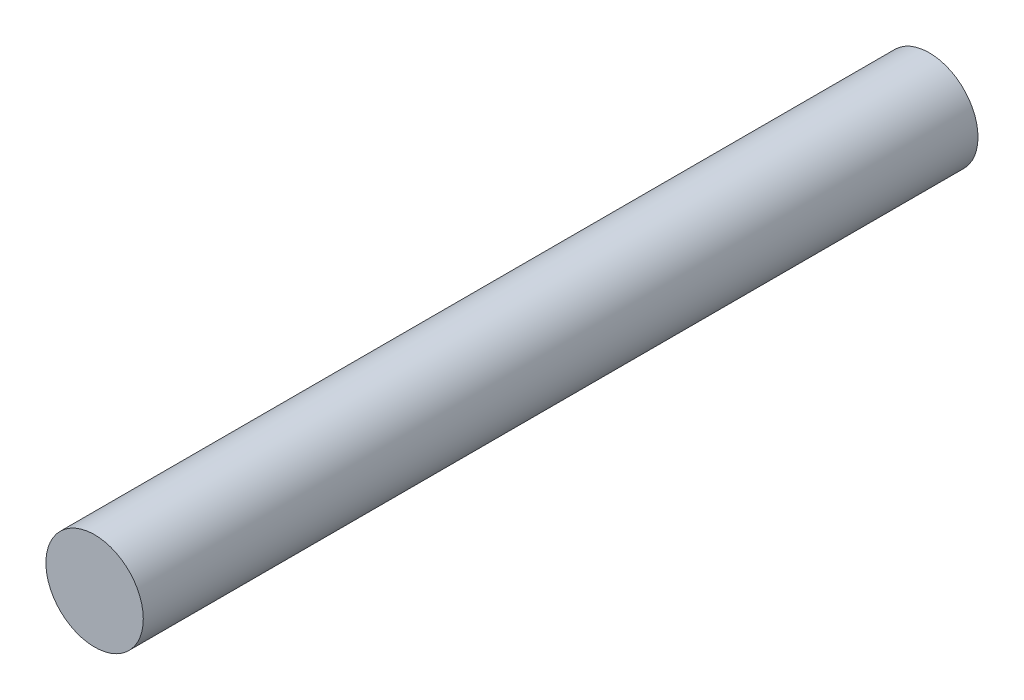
from build123d import *

# Parameters (mm, degrees)
SKETCH1_R           = 1.75
BOSS_EXTRUDE1_DEPTH = 30


with BuildPart() as part:
    # Sketch1 → Boss-Extrude1 (new body)
    with BuildSketch(Plane.XY):
        Circle(SKETCH1_R)
    extrude(amount=BOSS_EXTRUDE1_DEPTH)


solid = part.part
